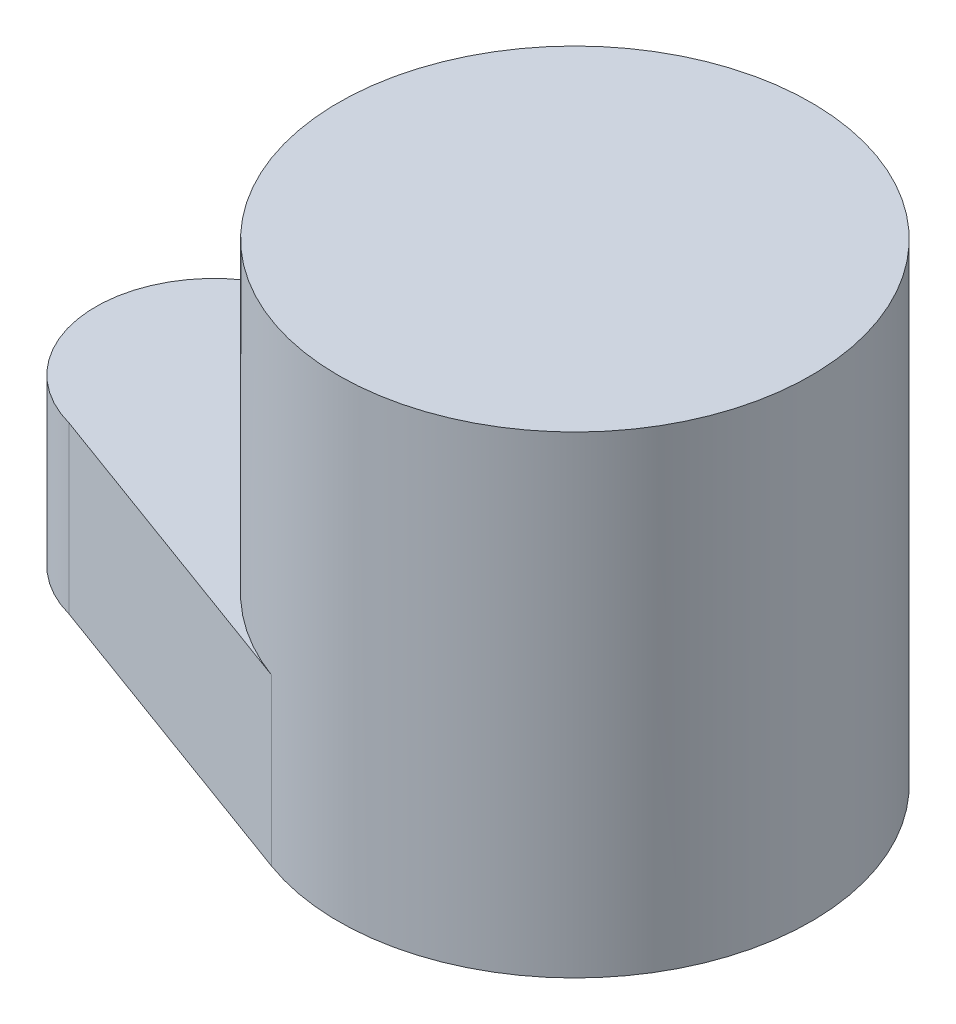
from build123d import *

# Parameters (mm, degrees)
SKETCH_2_R      = 50
EXTRUDE_3_DEPTH = 100
EXTRUDE_4_DEPTH = 35


with BuildPart() as part:
    # Sketch 2 → Extrude 3 (new body)
    with BuildSketch(Plane(origin=(0, 0, 0), x_dir=(1, 0, 0), z_dir=(0, 1, 0))):
        with Locations(Location((46.233661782, -1.943360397, 0), (0, 0, 270))):
            Circle(SKETCH_2_R)
    extrude(amount=EXTRUDE_3_DEPTH)

    # Sketch 2_5 → Extrude 4 (add)
    with BuildSketch(Plane(origin=(0, 0, 0), x_dir=(1, 0, 0), z_dir=(0, 1, 0))):
        with BuildLine():
            Line((31.438522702, 45.817542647), (-38.513504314, 24.148145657))
            ThreePointArc((-38.513504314, 24.148145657), (-57.043028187, 0), (-38.513504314, -24.148145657))
            Line((-38.513504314, -24.148145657), (29.035387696, -48.892475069))
            ThreePointArc((29.035387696, -48.892475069), (-3.750250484, -0.675088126), (31.438522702, 45.817542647))
        make_face()
    extrude(amount=EXTRUDE_4_DEPTH)


solid = part.part
